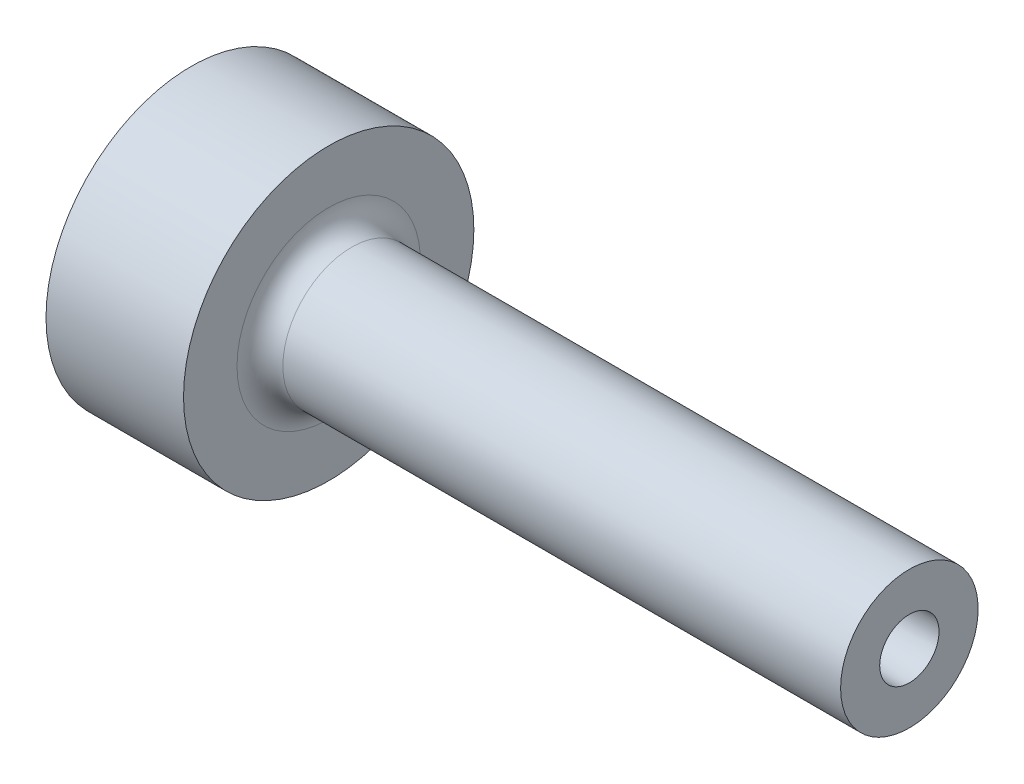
ISO-10303-21;
HEADER;
FILE_DESCRIPTION(('STEP AP214'),'2;1');
FILE_NAME('part.step','',(''),(''),'','','');
FILE_SCHEMA(('AUTOMOTIVE_DESIGN { 1 0 10303 214 1 1 1 1 }'));
ENDSEC;
DATA;
#1=APPLICATION_CONTEXT('core data for automotive mechanical design processes');
#2=APPLICATION_PROTOCOL_DEFINITION('international standard','automotive_design',2000,#1);
#3=PRODUCT_CONTEXT('',#1,'mechanical');
#4=PRODUCT('Part','Part','',(#3));
#5=PRODUCT_RELATED_PRODUCT_CATEGORY('part','',(#4));
#6=PRODUCT_DEFINITION_FORMATION('','',#4);
#7=PRODUCT_DEFINITION_CONTEXT('part definition',#1,'design');
#8=PRODUCT_DEFINITION('design','',#6,#7);
#9=PRODUCT_DEFINITION_SHAPE('','',#8);
#10=(LENGTH_UNIT() NAMED_UNIT(*) SI_UNIT(.MILLI.,.METRE.));
#11=(NAMED_UNIT(*) PLANE_ANGLE_UNIT() SI_UNIT($,.RADIAN.));
#12=(NAMED_UNIT(*) SI_UNIT($,.STERADIAN.) SOLID_ANGLE_UNIT());
#13=UNCERTAINTY_MEASURE_WITH_UNIT(LENGTH_MEASURE(1.E-05),#10,'distance_accuracy_value','');
#14=(GEOMETRIC_REPRESENTATION_CONTEXT(3) GLOBAL_UNCERTAINTY_ASSIGNED_CONTEXT((#13)) GLOBAL_UNIT_ASSIGNED_CONTEXT((#10,
#11,#12)) REPRESENTATION_CONTEXT('',''));
#15=CARTESIAN_POINT('',(0.,0.,0.));
#16=DIRECTION('',(0.,0.,1.));
#17=DIRECTION('',(1.,0.,0.));
#18=AXIS2_PLACEMENT_3D('',#15,#16,#17);
#19=CARTESIAN_POINT('',(0.,0.,0.));
#20=DIRECTION('',(-1.,0.,0.));
#21=DIRECTION('',(0.,0.,1.));
#22=AXIS2_PLACEMENT_3D('',#19,#20,#21);
#23=CYLINDRICAL_SURFACE('',#22,19.);
#24=CARTESIAN_POINT('',(18.,0.,0.));
#25=DIRECTION('',(-1.,0.,0.));
#26=DIRECTION('',(0.,0.,1.));
#27=AXIS2_PLACEMENT_3D('',#24,#25,#26);
#28=CIRCLE('',#27,19.);
#29=CARTESIAN_POINT('',(18.,0.,19.));
#30=VERTEX_POINT('',#29);
#31=EDGE_CURVE('E90',#30,#30,#28,.T.);
#32=ORIENTED_EDGE('',*,*,#31,.T.);
#33=EDGE_LOOP('',(#32));
#34=FACE_BOUND('',#33,.T.);
#35=CARTESIAN_POINT('',(0.,0.,0.));
#36=DIRECTION('',(-1.,0.,0.));
#37=DIRECTION('',(0.,0.,1.));
#38=AXIS2_PLACEMENT_3D('',#35,#36,#37);
#39=CIRCLE('',#38,19.);
#40=CARTESIAN_POINT('',(0.,0.,19.));
#41=VERTEX_POINT('',#40);
#42=EDGE_CURVE('E84',#41,#41,#39,.T.);
#43=ORIENTED_EDGE('',*,*,#42,.F.);
#44=EDGE_LOOP('',(#43));
#45=FACE_BOUND('',#44,.T.);
#46=CARTESIAN_POINT('',(11.,-19.,0.));
#47=CARTESIAN_POINT('',(10.9999951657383,-18.9999986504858,0.11200841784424));
#48=CARTESIAN_POINT('',(10.9905588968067,-18.9989990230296,0.224090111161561));
#49=CARTESIAN_POINT('',(10.953059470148,-18.9951074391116,0.445143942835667));
#50=CARTESIAN_POINT('',(10.9249759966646,-18.9922134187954,0.554112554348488));
#51=CARTESIAN_POINT('',(10.8510107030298,-18.9848596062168,0.765707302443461));
#52=CARTESIAN_POINT('',(10.8051398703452,-18.9804007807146,0.868337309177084));
#53=CARTESIAN_POINT('',(10.696923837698,-18.9704154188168,1.06441973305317));
#54=CARTESIAN_POINT('',(10.6345818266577,-18.9648890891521,1.15787392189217));
#55=CARTESIAN_POINT('',(10.494927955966,-18.9533628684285,1.33334438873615));
#56=CARTESIAN_POINT('',(10.417564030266,-18.9473613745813,1.41531912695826));
#57=CARTESIAN_POINT('',(10.2501736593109,-18.9355744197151,1.565146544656));
#58=CARTESIAN_POINT('',(10.1601466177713,-18.9297889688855,1.63299855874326));
#59=CARTESIAN_POINT('',(9.96972339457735,-18.9190729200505,1.75280323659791));
#60=CARTESIAN_POINT('',(9.86930325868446,-18.914144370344,1.80471802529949));
#61=CARTESIAN_POINT('',(9.66111022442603,-18.9057203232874,1.89093273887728));
#62=CARTESIAN_POINT('',(9.55333752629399,-18.90222478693,1.92523314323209));
#63=CARTESIAN_POINT('',(9.333924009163,-18.8970772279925,1.97512160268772));
#64=CARTESIAN_POINT('',(9.22229908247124,-18.89541839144,1.99077883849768));
#65=CARTESIAN_POINT('',(8.99799439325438,-18.8941109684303,2.0031504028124));
#66=CARTESIAN_POINT('',(8.88531466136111,-18.8944623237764,1.99986527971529));
#67=CARTESIAN_POINT('',(8.66257681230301,-18.8971293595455,1.97450235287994));
#68=CARTESIAN_POINT('',(8.55250997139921,-18.8994371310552,1.9525002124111));
#69=CARTESIAN_POINT('',(8.33763983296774,-18.9057446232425,1.89044560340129));
#70=CARTESIAN_POINT('',(8.23283661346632,-18.9097443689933,1.85039286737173));
#71=CARTESIAN_POINT('',(8.0312304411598,-18.9189942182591,1.75329092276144));
#72=CARTESIAN_POINT('',(7.93444370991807,-18.924246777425,1.69620827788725));
#73=CARTESIAN_POINT('',(7.75179548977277,-18.9354083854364,1.5666908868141));
#74=CARTESIAN_POINT('',(7.66593435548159,-18.9413174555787,1.49425564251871));
#75=CARTESIAN_POINT('',(7.50713503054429,-18.9531615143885,1.33566725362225));
#76=CARTESIAN_POINT('',(7.43426205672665,-18.9590964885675,1.24944878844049));
#77=CARTESIAN_POINT('',(7.30401357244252,-18.9702964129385,1.06596783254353));
#78=CARTESIAN_POINT('',(7.24663808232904,-18.9755613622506,0.968705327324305));
#79=CARTESIAN_POINT('',(7.14901535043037,-18.9848300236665,0.765851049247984));
#80=CARTESIAN_POINT('',(7.10877156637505,-18.9888334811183,0.660257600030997));
#81=CARTESIAN_POINT('',(7.04660317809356,-18.9951255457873,0.443760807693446));
#82=CARTESIAN_POINT('',(7.02467796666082,-18.9974142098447,0.332857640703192));
#83=CARTESIAN_POINT('',(6.9998521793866,-19.0000115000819,0.109454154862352));
#84=CARTESIAN_POINT('',(6.9968616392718,-19.0003294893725,-0.00303606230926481));
#85=CARTESIAN_POINT('',(7.00975357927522,-18.9989747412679,-0.226916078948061));
#86=CARTESIAN_POINT('',(7.02563577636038,-18.9973020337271,-0.338305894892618));
#87=CARTESIAN_POINT('',(7.07574769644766,-18.9921598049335,-0.556562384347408));
#88=CARTESIAN_POINT('',(7.10993514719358,-18.9886944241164,-0.663438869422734));
#89=CARTESIAN_POINT('',(7.1956435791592,-18.9803554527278,-0.869940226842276));
#90=CARTESIAN_POINT('',(7.24716498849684,-18.9754818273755,-0.969564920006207));
#91=CARTESIAN_POINT('',(7.36630089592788,-18.9648478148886,-1.1591405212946));
#92=CARTESIAN_POINT('',(7.43397432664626,-18.9590842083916,-1.2490542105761));
#93=CARTESIAN_POINT('',(7.58340899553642,-18.9473268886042,-1.4162783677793));
#94=CARTESIAN_POINT('',(7.665170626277,-18.9413331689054,-1.49358848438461));
#95=CARTESIAN_POINT('',(7.84085406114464,-18.9297628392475,-1.63372463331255));
#96=CARTESIAN_POINT('',(7.93482318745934,-18.9241879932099,-1.69649150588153));
#97=CARTESIAN_POINT('',(8.13202150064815,-18.9141138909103,-1.80535237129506));
#98=CARTESIAN_POINT('',(8.23525054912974,-18.9096146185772,-1.85144661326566));
#99=CARTESIAN_POINT('',(8.44783784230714,-18.9022123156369,-1.9255553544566));
#100=CARTESIAN_POINT('',(8.55718382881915,-18.8993062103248,-1.95360469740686));
#101=CARTESIAN_POINT('',(8.77906579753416,-18.8954098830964,-1.99094032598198));
#102=CARTESIAN_POINT('',(8.89160167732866,-18.8944195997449,-2.00022721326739));
#103=CARTESIAN_POINT('',(9.11608086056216,-18.8944684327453,-1.99976544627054));
#104=CARTESIAN_POINT('',(9.22802436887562,-18.8954976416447,-1.99010972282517));
#105=CARTESIAN_POINT('',(9.4486892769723,-18.8994483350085,-1.95223204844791));
#106=CARTESIAN_POINT('',(9.55741067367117,-18.9023698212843,-1.92401007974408));
#107=CARTESIAN_POINT('',(9.76854219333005,-18.9097730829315,-1.8498273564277));
#108=CARTESIAN_POINT('',(9.87095340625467,-18.914254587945,-1.80386967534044));
#109=CARTESIAN_POINT('',(10.0666237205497,-18.92427346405,-1.69552954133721));
#110=CARTESIAN_POINT('',(10.1598828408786,-18.9298108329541,-1.63314712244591));
#111=CARTESIAN_POINT('',(10.3350778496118,-18.9413500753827,-1.49337993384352));
#112=CARTESIAN_POINT('',(10.4169583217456,-18.9473540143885,-1.41592586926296));
#113=CARTESIAN_POINT('',(10.5665993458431,-18.9591311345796,-1.24835332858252));
#114=CARTESIAN_POINT('',(10.6343565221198,-18.9649042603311,-1.15823183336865));
#115=CARTESIAN_POINT('',(10.7539774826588,-18.975586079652,-0.967607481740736));
#116=CARTESIAN_POINT('',(10.8057969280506,-18.9804923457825,-0.867076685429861));
#117=CARTESIAN_POINT('',(10.8917493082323,-18.9888617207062,-0.658751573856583));
#118=CARTESIAN_POINT('',(10.9259020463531,-18.9923264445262,-0.550965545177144));
#119=CARTESIAN_POINT('',(10.9671005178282,-18.9965585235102,-0.368815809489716));
#120=CARTESIAN_POINT('',(10.9794208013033,-18.9978430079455,-0.295613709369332));
#121=CARTESIAN_POINT('',(10.9958721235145,-18.9995641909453,-0.148285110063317));
#122=CARTESIAN_POINT('',(11.0000032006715,-19.0000008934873,-0.0741586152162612));
#123=CARTESIAN_POINT('',(11.,-19.,0.));
#124=B_SPLINE_CURVE_WITH_KNOTS('',3,(#46,#47,#48,#49,#50,#51,#52,#53,#54,#55,#56,#57,#58,#59,
#60,#61,#62,#63,#64,#65,#66,#67,#68,#69,#70,#71,#72,#73,#74,#75,#76,#77,#78,#79,#80,#81,#82,#83,
#84,#85,#86,#87,#88,#89,#90,#91,#92,#93,#94,#95,#96,#97,#98,#99,#100,#101,#102,#103,#104,#105,
#106,#107,#108,#109,#110,#111,#112,#113,#114,#115,#116,#117,#118,#119,#120,#121,#122,#123),
.UNSPECIFIED.,.T.,.F.,(4,2,2,2,2,2,2,2,2,2,2,2,2,2,2,2,2,2,2,2,2,2,2,2,2,2,2,2,2,2,2,2,2,2,2,2,
2,2,4),(0.,0.335754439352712,0.671875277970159,1.00778882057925,1.34363737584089,
1.68067146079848,2.01772142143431,2.35556629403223,2.69340196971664,3.02998006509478,
3.36654841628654,3.7017626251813,4.03698180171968,4.37286352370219,4.70875614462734,
5.0462905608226,5.38382542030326,5.72142837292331,6.05902013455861,6.39500668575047,
6.73098819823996,7.06619715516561,7.40141439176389,7.73787392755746,8.07434284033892,
8.41215732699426,8.74996676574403,9.08712193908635,9.42426630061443,9.75976079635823,
10.095255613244,10.4306923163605,10.7661283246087,11.103144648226,11.4402414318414,
11.7782677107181,12.1159142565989,12.3382118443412,12.5605083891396),.UNSPECIFIED.);
#125=CARTESIAN_POINT('',(11.,-19.,0.));
#126=VERTEX_POINT('',#125);
#127=EDGE_CURVE('E10',#126,#126,#124,.T.);
#128=ORIENTED_EDGE('',*,*,#127,.F.);
#129=EDGE_LOOP('',(#128));
#130=FACE_BOUND('',#129,.T.);
#131=ADVANCED_FACE('F16',(#34,#45,#130),#23,.T.);
#132=CARTESIAN_POINT('',(0.,0.,0.));
#133=DIRECTION('',(1.,0.,0.));
#134=DIRECTION('',(0.,0.,-1.));
#135=AXIS2_PLACEMENT_3D('',#132,#133,#134);
#136=CONICAL_SURFACE('',#135,1.75,0.0226892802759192);
#137=CARTESIAN_POINT('',(94.,0.,0.));
#138=DIRECTION('',(-1.,0.,0.));
#139=DIRECTION('',(0.,0.,1.));
#140=AXIS2_PLACEMENT_3D('',#137,#138,#139);
#141=CIRCLE('',#140,3.88315841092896);
#142=CARTESIAN_POINT('',(94.,0.,3.88315841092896));
#143=VERTEX_POINT('',#142);
#144=EDGE_CURVE('E77',#143,#143,#141,.T.);
#145=ORIENTED_EDGE('',*,*,#144,.F.);
#146=EDGE_LOOP('',(#145));
#147=FACE_BOUND('',#146,.T.);
#148=CARTESIAN_POINT('',(3.86351757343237,0.,0.));
#149=DIRECTION('',(-1.,0.,0.));
#150=DIRECTION('',(0.,0.,1.));
#151=AXIS2_PLACEMENT_3D('',#148,#149,#150);
#152=CIRCLE('',#151,1.83767547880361);
#153=CARTESIAN_POINT('',(3.86351757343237,0.,1.83767547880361));
#154=VERTEX_POINT('',#153);
#155=EDGE_CURVE('E96',#154,#154,#152,.F.);
#156=ORIENTED_EDGE('',*,*,#155,.F.);
#157=EDGE_LOOP('',(#156));
#158=FACE_BOUND('',#157,.T.);
#159=ADVANCED_FACE('F44',(#147,#158),#136,.F.);
#160=CARTESIAN_POINT('',(21.,0.,0.));
#161=DIRECTION('',(-1.,0.,0.));
#162=DIRECTION('',(0.,0.,1.));
#163=AXIS2_PLACEMENT_3D('',#160,#161,#162);
#164=TOROIDAL_SURFACE('',#163,12.,3.);
#165=CARTESIAN_POINT('',(18.,0.,0.));
#166=DIRECTION('',(-1.,0.,0.));
#167=DIRECTION('',(0.,0.,1.));
#168=AXIS2_PLACEMENT_3D('',#165,#166,#167);
#169=CIRCLE('',#168,12.);
#170=CARTESIAN_POINT('',(18.,0.,12.));
#171=VERTEX_POINT('',#170);
#172=EDGE_CURVE('E93',#171,#171,#169,.T.);
#173=ORIENTED_EDGE('',*,*,#172,.F.);
#174=EDGE_LOOP('',(#173));
#175=FACE_BOUND('',#174,.T.);
#176=CARTESIAN_POINT('',(21.,0.,0.));
#177=DIRECTION('',(-1.,0.,0.));
#178=DIRECTION('',(0.,0.,1.));
#179=AXIS2_PLACEMENT_3D('',#176,#177,#178);
#180=CIRCLE('',#179,9.);
#181=CARTESIAN_POINT('',(21.,0.,9.));
#182=VERTEX_POINT('',#181);
#183=EDGE_CURVE('E29',#182,#182,#180,.T.);
#184=ORIENTED_EDGE('',*,*,#183,.T.);
#185=EDGE_LOOP('',(#184));
#186=FACE_BOUND('',#185,.T.);
#187=ADVANCED_FACE('F18',(#175,#186),#164,.F.);
#188=CARTESIAN_POINT('',(0.,0.,0.));
#189=DIRECTION('',(-1.,0.,0.));
#190=DIRECTION('',(0.,0.,1.));
#191=AXIS2_PLACEMENT_3D('',#188,#189,#190);
#192=CYLINDRICAL_SURFACE('',#191,9.);
#193=ORIENTED_EDGE('',*,*,#183,.F.);
#194=EDGE_LOOP('',(#193));
#195=FACE_BOUND('',#194,.T.);
#196=CARTESIAN_POINT('',(94.,0.,0.));
#197=DIRECTION('',(-1.,0.,0.));
#198=DIRECTION('',(0.,0.,1.));
#199=AXIS2_PLACEMENT_3D('',#196,#197,#198);
#200=CIRCLE('',#199,9.);
#201=CARTESIAN_POINT('',(94.,0.,9.));
#202=VERTEX_POINT('',#201);
#203=EDGE_CURVE('E75',#202,#202,#200,.T.);
#204=ORIENTED_EDGE('',*,*,#203,.T.);
#205=EDGE_LOOP('',(#204));
#206=FACE_BOUND('',#205,.T.);
#207=ADVANCED_FACE('F63',(#195,#206),#192,.T.);
#208=CARTESIAN_POINT('',(94.,9.,0.));
#209=DIRECTION('',(-1.,0.,0.));
#210=DIRECTION('',(0.,0.,1.));
#211=AXIS2_PLACEMENT_3D('',#208,#209,#210);
#212=PLANE('',#211);
#213=ORIENTED_EDGE('',*,*,#203,.F.);
#214=EDGE_LOOP('',(#213));
#215=FACE_BOUND('',#214,.T.);
#216=ORIENTED_EDGE('',*,*,#144,.T.);
#217=EDGE_LOOP('',(#216));
#218=FACE_BOUND('',#217,.T.);
#219=ADVANCED_FACE('F59',(#215,#218),#212,.F.);
#220=CARTESIAN_POINT('',(0.,1.75,0.));
#221=DIRECTION('',(1.,0.,0.));
#222=DIRECTION('',(0.,0.,-1.));
#223=AXIS2_PLACEMENT_3D('',#220,#221,#222);
#224=PLANE('',#223);
#225=CARTESIAN_POINT('',(0.,0.,0.));
#226=DIRECTION('',(-1.,0.,0.));
#227=DIRECTION('',(0.,0.,1.));
#228=AXIS2_PLACEMENT_3D('',#225,#226,#227);
#229=CIRCLE('',#228,15.5);
#230=CARTESIAN_POINT('',(0.,0.,15.5));
#231=VERTEX_POINT('',#230);
#232=EDGE_CURVE('E100',#231,#231,#229,.T.);
#233=ORIENTED_EDGE('',*,*,#232,.F.);
#234=EDGE_LOOP('',(#233));
#235=FACE_BOUND('',#234,.T.);
#236=ORIENTED_EDGE('',*,*,#42,.T.);
#237=EDGE_LOOP('',(#236));
#238=FACE_BOUND('',#237,.T.);
#239=ADVANCED_FACE('F57',(#235,#238),#224,.F.);
#240=CARTESIAN_POINT('',(18.,19.,0.));
#241=DIRECTION('',(-1.,0.,0.));
#242=DIRECTION('',(0.,0.,1.));
#243=AXIS2_PLACEMENT_3D('',#240,#241,#242);
#244=PLANE('',#243);
#245=ORIENTED_EDGE('',*,*,#31,.F.);
#246=EDGE_LOOP('',(#245));
#247=FACE_BOUND('',#246,.T.);
#248=ORIENTED_EDGE('',*,*,#172,.T.);
#249=EDGE_LOOP('',(#248));
#250=FACE_BOUND('',#249,.T.);
#251=ADVANCED_FACE('F55',(#247,#250),#244,.F.);
#252=CARTESIAN_POINT('',(-35.9477938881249,0.,0.));
#253=DIRECTION('',(-1.,0.,0.));
#254=DIRECTION('',(0.,0.,1.));
#255=AXIS2_PLACEMENT_3D('',#252,#253,#254);
#256=DEGENERATE_TOROIDAL_SURFACE('',#255,2.0429790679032,40.,.F.);
#257=ORIENTED_EDGE('',*,*,#232,.T.);
#258=EDGE_LOOP('',(#257));
#259=FACE_BOUND('',#258,.T.);
#260=ORIENTED_EDGE('',*,*,#155,.T.);
#261=EDGE_LOOP('',(#260));
#262=FACE_BOUND('',#261,.T.);
#263=ADVANCED_FACE('F40',(#259,#262),#256,.T.);
#264=CARTESIAN_POINT('',(9.,-19.,0.));
#265=DIRECTION('',(0.,-1.,0.));
#266=DIRECTION('',(1.,0.,0.));
#267=AXIS2_PLACEMENT_3D('',#264,#265,#266);
#268=CYLINDRICAL_SURFACE('',#267,2.);
#269=CARTESIAN_POINT('',(9.,-13.,0.));
#270=DIRECTION('',(0.,-1.,0.));
#271=DIRECTION('',(1.,0.,0.));
#272=AXIS2_PLACEMENT_3D('',#269,#270,#271);
#273=CIRCLE('',#272,2.);
#274=CARTESIAN_POINT('',(11.,-13.,0.));
#275=VERTEX_POINT('',#274);
#276=EDGE_CURVE('E104',#275,#275,#273,.T.);
#277=ORIENTED_EDGE('',*,*,#276,.F.);
#278=EDGE_LOOP('',(#277));
#279=FACE_BOUND('',#278,.T.);
#280=ORIENTED_EDGE('',*,*,#127,.T.);
#281=EDGE_LOOP('',(#280));
#282=FACE_BOUND('',#281,.T.);
#283=ADVANCED_FACE('F34',(#279,#282),#268,.F.);
#284=CARTESIAN_POINT('',(9.,-11.8452994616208,0.));
#285=DIRECTION('',(0.,-1.,0.));
#286=DIRECTION('',(1.,0.,0.));
#287=AXIS2_PLACEMENT_3D('',#284,#285,#286);
#288=CONICAL_SURFACE('',#287,0.,1.0471975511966);
#289=ORIENTED_EDGE('',*,*,#276,.T.);
#290=EDGE_LOOP('',(#289));
#291=FACE_BOUND('',#290,.T.);
#292=CARTESIAN_POINT('',(9.,-11.8452994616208,0.));
#293=VERTEX_POINT('',#292);
#294=VERTEX_LOOP('',#293);
#295=FACE_BOUND('',#294,.T.);
#296=ADVANCED_FACE('F32',(#291,#295),#288,.F.);
#297=CLOSED_SHELL('',(#131,#159,#187,#207,#219,#239,#251,#263,#283,#296));
#298=MANIFOLD_SOLID_BREP('B1',#297);
#299=ADVANCED_BREP_SHAPE_REPRESENTATION('',(#18,#298),#14);
#300=SHAPE_DEFINITION_REPRESENTATION(#9,#299);
ENDSEC;
END-ISO-10303-21;
